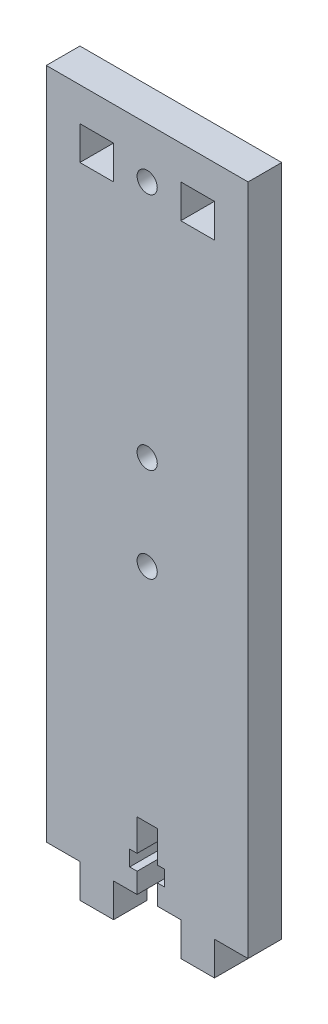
ISO-10303-21;
HEADER;
FILE_DESCRIPTION(('STEP AP214'),'2;1');
FILE_NAME('part.step','',(''),(''),'','','');
FILE_SCHEMA(('AUTOMOTIVE_DESIGN { 1 0 10303 214 1 1 1 1 }'));
ENDSEC;
DATA;
#1=APPLICATION_CONTEXT('core data for automotive mechanical design processes');
#2=APPLICATION_PROTOCOL_DEFINITION('international standard','automotive_design',2000,#1);
#3=PRODUCT_CONTEXT('',#1,'mechanical');
#4=PRODUCT('Part','Part','',(#3));
#5=PRODUCT_RELATED_PRODUCT_CATEGORY('part','',(#4));
#6=PRODUCT_DEFINITION_FORMATION('','',#4);
#7=PRODUCT_DEFINITION_CONTEXT('part definition',#1,'design');
#8=PRODUCT_DEFINITION('design','',#6,#7);
#9=PRODUCT_DEFINITION_SHAPE('','',#8);
#10=(LENGTH_UNIT() NAMED_UNIT(*) SI_UNIT(.MILLI.,.METRE.));
#11=(NAMED_UNIT(*) PLANE_ANGLE_UNIT() SI_UNIT($,.RADIAN.));
#12=(NAMED_UNIT(*) SI_UNIT($,.STERADIAN.) SOLID_ANGLE_UNIT());
#13=UNCERTAINTY_MEASURE_WITH_UNIT(LENGTH_MEASURE(1.E-05),#10,'distance_accuracy_value','');
#14=(GEOMETRIC_REPRESENTATION_CONTEXT(3) GLOBAL_UNCERTAINTY_ASSIGNED_CONTEXT((#13)) GLOBAL_UNIT_ASSIGNED_CONTEXT((#10,
#11,#12)) REPRESENTATION_CONTEXT('',''));
#15=CARTESIAN_POINT('',(0.,0.,0.));
#16=DIRECTION('',(0.,0.,1.));
#17=DIRECTION('',(1.,0.,0.));
#18=AXIS2_PLACEMENT_3D('',#15,#16,#17);
#19=CARTESIAN_POINT('',(0.,0.,5.));
#20=DIRECTION('',(0.,0.,-1.));
#21=DIRECTION('',(-1.,0.,0.));
#22=AXIS2_PLACEMENT_3D('',#19,#20,#21);
#23=PLANE('',#22);
#24=DIRECTION('',(0.,1.,0.));
#25=VECTOR('',#24,1.);
#26=CARTESIAN_POINT('',(-5.,95.,5.));
#27=LINE('',#26,#25);
#28=CARTESIAN_POINT('',(-5.,90.,5.));
#29=VERTEX_POINT('',#28);
#30=CARTESIAN_POINT('',(-5.,95.,5.));
#31=VERTEX_POINT('',#30);
#32=EDGE_CURVE('E281',#29,#31,#27,.T.);
#33=ORIENTED_EDGE('',*,*,#32,.F.);
#34=DIRECTION('',(1.,0.,0.));
#35=VECTOR('',#34,1.);
#36=CARTESIAN_POINT('',(-5.,90.,5.));
#37=LINE('',#36,#35);
#38=CARTESIAN_POINT('',(-10.,90.,5.));
#39=VERTEX_POINT('',#38);
#40=EDGE_CURVE('E289',#39,#29,#37,.T.);
#41=ORIENTED_EDGE('',*,*,#40,.F.);
#42=DIRECTION('',(0.,-1.,0.));
#43=VECTOR('',#42,1.);
#44=CARTESIAN_POINT('',(-10.,95.,5.));
#45=LINE('',#44,#43);
#46=CARTESIAN_POINT('',(-10.,95.,5.));
#47=VERTEX_POINT('',#46);
#48=EDGE_CURVE('E286',#47,#39,#45,.T.);
#49=ORIENTED_EDGE('',*,*,#48,.F.);
#50=DIRECTION('',(-1.,0.,0.));
#51=VECTOR('',#50,1.);
#52=CARTESIAN_POINT('',(-5.,95.,5.));
#53=LINE('',#52,#51);
#54=EDGE_CURVE('E283',#31,#47,#53,.T.);
#55=ORIENTED_EDGE('',*,*,#54,.F.);
#56=EDGE_LOOP('',(#33,#41,#49,#55));
#57=FACE_BOUND('',#56,.T.);
#58=DIRECTION('',(0.,-1.,0.));
#59=VECTOR('',#58,1.);
#60=CARTESIAN_POINT('',(-15.,90.,5.));
#61=LINE('',#60,#59);
#62=CARTESIAN_POINT('',(-15.,100.,5.));
#63=VERTEX_POINT('',#62);
#64=CARTESIAN_POINT('',(-15.,0.,5.));
#65=VERTEX_POINT('',#64);
#66=EDGE_CURVE('E324',#63,#65,#61,.T.);
#67=ORIENTED_EDGE('',*,*,#66,.T.);
#68=DIRECTION('',(1.,0.,0.));
#69=VECTOR('',#68,1.);
#70=CARTESIAN_POINT('',(-10.,0.,5.));
#71=LINE('',#70,#69);
#72=CARTESIAN_POINT('',(-10.,0.,5.));
#73=VERTEX_POINT('',#72);
#74=EDGE_CURVE('E326',#65,#73,#71,.T.);
#75=ORIENTED_EDGE('',*,*,#74,.T.);
#76=DIRECTION('',(0.,-1.,0.));
#77=VECTOR('',#76,1.);
#78=CARTESIAN_POINT('',(-10.,-5.,5.));
#79=LINE('',#78,#77);
#80=CARTESIAN_POINT('',(-10.,-5.,5.));
#81=VERTEX_POINT('',#80);
#82=EDGE_CURVE('E329',#73,#81,#79,.T.);
#83=ORIENTED_EDGE('',*,*,#82,.T.);
#84=DIRECTION('',(1.,0.,0.));
#85=VECTOR('',#84,1.);
#86=CARTESIAN_POINT('',(-5.,-5.,5.));
#87=LINE('',#86,#85);
#88=CARTESIAN_POINT('',(-5.,-5.,5.));
#89=VERTEX_POINT('',#88);
#90=EDGE_CURVE('E331',#81,#89,#87,.T.);
#91=ORIENTED_EDGE('',*,*,#90,.T.);
#92=DIRECTION('',(0.,1.,0.));
#93=VECTOR('',#92,1.);
#94=CARTESIAN_POINT('',(-5.,-5.,5.));
#95=LINE('',#94,#93);
#96=CARTESIAN_POINT('',(-5.,0.,5.));
#97=VERTEX_POINT('',#96);
#98=EDGE_CURVE('E333',#89,#97,#95,.T.);
#99=ORIENTED_EDGE('',*,*,#98,.T.);
#100=DIRECTION('',(1.,0.,0.));
#101=VECTOR('',#100,1.);
#102=CARTESIAN_POINT('',(-1.5,0.,5.));
#103=LINE('',#102,#101);
#104=CARTESIAN_POINT('',(-1.5,0.,5.));
#105=VERTEX_POINT('',#104);
#106=EDGE_CURVE('E335',#97,#105,#103,.T.);
#107=ORIENTED_EDGE('',*,*,#106,.T.);
#108=DIRECTION('',(0.,1.,0.));
#109=VECTOR('',#108,1.);
#110=CARTESIAN_POINT('',(-1.5,3.,5.));
#111=LINE('',#110,#109);
#112=CARTESIAN_POINT('',(-1.5,3.,5.));
#113=VERTEX_POINT('',#112);
#114=EDGE_CURVE('E337',#105,#113,#111,.T.);
#115=ORIENTED_EDGE('',*,*,#114,.T.);
#116=DIRECTION('',(-1.,0.,0.));
#117=VECTOR('',#116,1.);
#118=CARTESIAN_POINT('',(-1.5,3.,5.));
#119=LINE('',#118,#117);
#120=CARTESIAN_POINT('',(-2.6,3.,5.));
#121=VERTEX_POINT('',#120);
#122=EDGE_CURVE('E339',#113,#121,#119,.T.);
#123=ORIENTED_EDGE('',*,*,#122,.T.);
#124=DIRECTION('',(0.,1.,0.));
#125=VECTOR('',#124,1.);
#126=CARTESIAN_POINT('',(-2.6,3.,5.));
#127=LINE('',#126,#125);
#128=CARTESIAN_POINT('',(-2.6,5.3,5.));
#129=VERTEX_POINT('',#128);
#130=EDGE_CURVE('E341',#121,#129,#127,.T.);
#131=ORIENTED_EDGE('',*,*,#130,.T.);
#132=DIRECTION('',(1.,0.,0.));
#133=VECTOR('',#132,1.);
#134=CARTESIAN_POINT('',(-2.6,5.3,5.));
#135=LINE('',#134,#133);
#136=CARTESIAN_POINT('',(-1.5,5.3,5.));
#137=VERTEX_POINT('',#136);
#138=EDGE_CURVE('E343',#129,#137,#135,.T.);
#139=ORIENTED_EDGE('',*,*,#138,.T.);
#140=DIRECTION('',(0.,1.,0.));
#141=VECTOR('',#140,1.);
#142=CARTESIAN_POINT('',(-1.5,10.,5.));
#143=LINE('',#142,#141);
#144=CARTESIAN_POINT('',(-1.5,10.,5.));
#145=VERTEX_POINT('',#144);
#146=EDGE_CURVE('E345',#137,#145,#143,.T.);
#147=ORIENTED_EDGE('',*,*,#146,.T.);
#148=DIRECTION('',(1.,0.,0.));
#149=VECTOR('',#148,1.);
#150=CARTESIAN_POINT('',(1.5,10.,5.));
#151=LINE('',#150,#149);
#152=CARTESIAN_POINT('',(1.5,10.,5.));
#153=VERTEX_POINT('',#152);
#154=EDGE_CURVE('E347',#145,#153,#151,.T.);
#155=ORIENTED_EDGE('',*,*,#154,.T.);
#156=DIRECTION('',(0.,-1.,0.));
#157=VECTOR('',#156,1.);
#158=CARTESIAN_POINT('',(1.5,5.3,5.));
#159=LINE('',#158,#157);
#160=CARTESIAN_POINT('',(1.5,5.3,5.));
#161=VERTEX_POINT('',#160);
#162=EDGE_CURVE('E349',#153,#161,#159,.T.);
#163=ORIENTED_EDGE('',*,*,#162,.T.);
#164=DIRECTION('',(1.,0.,0.));
#165=VECTOR('',#164,1.);
#166=CARTESIAN_POINT('',(1.5,5.3,5.));
#167=LINE('',#166,#165);
#168=CARTESIAN_POINT('',(2.6,5.3,5.));
#169=VERTEX_POINT('',#168);
#170=EDGE_CURVE('E351',#161,#169,#167,.T.);
#171=ORIENTED_EDGE('',*,*,#170,.T.);
#172=DIRECTION('',(0.,-1.,0.));
#173=VECTOR('',#172,1.);
#174=CARTESIAN_POINT('',(2.6,5.3,5.));
#175=LINE('',#174,#173);
#176=CARTESIAN_POINT('',(2.6,3.,5.));
#177=VERTEX_POINT('',#176);
#178=EDGE_CURVE('E353',#169,#177,#175,.T.);
#179=ORIENTED_EDGE('',*,*,#178,.T.);
#180=DIRECTION('',(-1.,0.,0.));
#181=VECTOR('',#180,1.);
#182=CARTESIAN_POINT('',(2.6,3.,5.));
#183=LINE('',#182,#181);
#184=CARTESIAN_POINT('',(1.5,3.,5.));
#185=VERTEX_POINT('',#184);
#186=EDGE_CURVE('E355',#177,#185,#183,.T.);
#187=ORIENTED_EDGE('',*,*,#186,.T.);
#188=DIRECTION('',(0.,-1.,0.));
#189=VECTOR('',#188,1.);
#190=CARTESIAN_POINT('',(1.5,0.,5.));
#191=LINE('',#190,#189);
#192=CARTESIAN_POINT('',(1.5,0.,5.));
#193=VERTEX_POINT('',#192);
#194=EDGE_CURVE('E357',#185,#193,#191,.T.);
#195=ORIENTED_EDGE('',*,*,#194,.T.);
#196=DIRECTION('',(1.,0.,0.));
#197=VECTOR('',#196,1.);
#198=CARTESIAN_POINT('',(1.5,0.,5.));
#199=LINE('',#198,#197);
#200=CARTESIAN_POINT('',(5.,0.,5.));
#201=VERTEX_POINT('',#200);
#202=EDGE_CURVE('E359',#193,#201,#199,.T.);
#203=ORIENTED_EDGE('',*,*,#202,.T.);
#204=DIRECTION('',(0.,-1.,0.));
#205=VECTOR('',#204,1.);
#206=CARTESIAN_POINT('',(5.,0.,5.));
#207=LINE('',#206,#205);
#208=CARTESIAN_POINT('',(5.,-5.,5.));
#209=VERTEX_POINT('',#208);
#210=EDGE_CURVE('E361',#201,#209,#207,.T.);
#211=ORIENTED_EDGE('',*,*,#210,.T.);
#212=DIRECTION('',(1.,0.,0.));
#213=VECTOR('',#212,1.);
#214=CARTESIAN_POINT('',(5.,-5.,5.));
#215=LINE('',#214,#213);
#216=CARTESIAN_POINT('',(10.,-5.,5.));
#217=VERTEX_POINT('',#216);
#218=EDGE_CURVE('E363',#209,#217,#215,.T.);
#219=ORIENTED_EDGE('',*,*,#218,.T.);
#220=DIRECTION('',(0.,1.,0.));
#221=VECTOR('',#220,1.);
#222=CARTESIAN_POINT('',(10.,-5.,5.));
#223=LINE('',#222,#221);
#224=CARTESIAN_POINT('',(10.,0.,5.));
#225=VERTEX_POINT('',#224);
#226=EDGE_CURVE('E365',#217,#225,#223,.T.);
#227=ORIENTED_EDGE('',*,*,#226,.T.);
#228=DIRECTION('',(1.,0.,0.));
#229=VECTOR('',#228,1.);
#230=CARTESIAN_POINT('',(15.,0.,5.));
#231=LINE('',#230,#229);
#232=CARTESIAN_POINT('',(15.,0.,5.));
#233=VERTEX_POINT('',#232);
#234=EDGE_CURVE('E367',#225,#233,#231,.T.);
#235=ORIENTED_EDGE('',*,*,#234,.T.);
#236=DIRECTION('',(0.,1.,0.));
#237=VECTOR('',#236,1.);
#238=CARTESIAN_POINT('',(15.,90.,5.));
#239=LINE('',#238,#237);
#240=CARTESIAN_POINT('',(15.,100.,5.));
#241=VERTEX_POINT('',#240);
#242=EDGE_CURVE('E369',#233,#241,#239,.T.);
#243=ORIENTED_EDGE('',*,*,#242,.T.);
#244=DIRECTION('',(-1.,0.,0.));
#245=VECTOR('',#244,1.);
#246=CARTESIAN_POINT('',(-15.,100.,5.));
#247=LINE('',#246,#245);
#248=EDGE_CURVE('E371',#241,#63,#247,.T.);
#249=ORIENTED_EDGE('',*,*,#248,.T.);
#250=EDGE_LOOP('',(#67,#75,#83,#91,#99,#107,#115,#123,#131,#139,#147,#155,#163,#171,#179,#187,
#195,#203,#211,#219,#227,#235,#243,#249));
#251=FACE_BOUND('',#250,.T.);
#252=CARTESIAN_POINT('',(0.,57.,5.));
#253=DIRECTION('',(0.,0.,1.));
#254=DIRECTION('',(1.,0.,0.));
#255=AXIS2_PLACEMENT_3D('',#252,#253,#254);
#256=CIRCLE('',#255,1.5);
#257=CARTESIAN_POINT('',(1.5,57.,5.));
#258=VERTEX_POINT('',#257);
#259=EDGE_CURVE('E318',#258,#258,#256,.T.);
#260=ORIENTED_EDGE('',*,*,#259,.F.);
#261=EDGE_LOOP('',(#260));
#262=FACE_BOUND('',#261,.T.);
#263=CARTESIAN_POINT('',(0.,43.,5.));
#264=DIRECTION('',(0.,0.,1.));
#265=DIRECTION('',(1.,0.,0.));
#266=AXIS2_PLACEMENT_3D('',#263,#264,#265);
#267=CIRCLE('',#266,1.5);
#268=CARTESIAN_POINT('',(1.5,43.,5.));
#269=VERTEX_POINT('',#268);
#270=EDGE_CURVE('E312',#269,#269,#267,.T.);
#271=ORIENTED_EDGE('',*,*,#270,.F.);
#272=EDGE_LOOP('',(#271));
#273=FACE_BOUND('',#272,.T.);
#274=DIRECTION('',(0.,-1.,0.));
#275=VECTOR('',#274,1.);
#276=CARTESIAN_POINT('',(5.,95.,5.));
#277=LINE('',#276,#275);
#278=CARTESIAN_POINT('',(5.,95.,5.));
#279=VERTEX_POINT('',#278);
#280=CARTESIAN_POINT('',(5.,90.,5.));
#281=VERTEX_POINT('',#280);
#282=EDGE_CURVE('E242',#279,#281,#277,.T.);
#283=ORIENTED_EDGE('',*,*,#282,.F.);
#284=DIRECTION('',(-1.,0.,0.));
#285=VECTOR('',#284,1.);
#286=CARTESIAN_POINT('',(5.,95.,5.));
#287=LINE('',#286,#285);
#288=CARTESIAN_POINT('',(10.,95.,5.));
#289=VERTEX_POINT('',#288);
#290=EDGE_CURVE('E265',#289,#279,#287,.T.);
#291=ORIENTED_EDGE('',*,*,#290,.F.);
#292=DIRECTION('',(0.,1.,0.));
#293=VECTOR('',#292,1.);
#294=CARTESIAN_POINT('',(10.,95.,5.));
#295=LINE('',#294,#293);
#296=CARTESIAN_POINT('',(10.,90.,5.));
#297=VERTEX_POINT('',#296);
#298=EDGE_CURVE('E263',#297,#289,#295,.T.);
#299=ORIENTED_EDGE('',*,*,#298,.F.);
#300=DIRECTION('',(1.,0.,0.));
#301=VECTOR('',#300,1.);
#302=CARTESIAN_POINT('',(5.,90.,5.));
#303=LINE('',#302,#301);
#304=EDGE_CURVE('E250',#281,#297,#303,.T.);
#305=ORIENTED_EDGE('',*,*,#304,.F.);
#306=EDGE_LOOP('',(#283,#291,#299,#305));
#307=FACE_BOUND('',#306,.T.);
#308=CARTESIAN_POINT('',(0.,92.5,5.));
#309=DIRECTION('',(0.,0.,1.));
#310=DIRECTION('',(1.,0.,0.));
#311=AXIS2_PLACEMENT_3D('',#308,#309,#310);
#312=CIRCLE('',#311,1.5);
#313=CARTESIAN_POINT('',(1.5,92.5,5.));
#314=VERTEX_POINT('',#313);
#315=EDGE_CURVE('E271',#314,#314,#312,.T.);
#316=ORIENTED_EDGE('',*,*,#315,.F.);
#317=EDGE_LOOP('',(#316));
#318=FACE_BOUND('',#317,.T.);
#319=ADVANCED_FACE('F33',(#57,#251,#262,#273,#307,#318),#23,.F.);
#320=CARTESIAN_POINT('',(0.,0.,0.));
#321=DIRECTION('',(0.,0.,-1.));
#322=DIRECTION('',(-1.,0.,0.));
#323=AXIS2_PLACEMENT_3D('',#320,#321,#322);
#324=PLANE('',#323);
#325=DIRECTION('',(-1.,0.,0.));
#326=VECTOR('',#325,1.);
#327=CARTESIAN_POINT('',(5.,95.,0.));
#328=LINE('',#327,#326);
#329=CARTESIAN_POINT('',(10.,95.,0.));
#330=VERTEX_POINT('',#329);
#331=CARTESIAN_POINT('',(5.,95.,0.));
#332=VERTEX_POINT('',#331);
#333=EDGE_CURVE('E251',#330,#332,#328,.T.);
#334=ORIENTED_EDGE('',*,*,#333,.T.);
#335=DIRECTION('',(0.,-1.,0.));
#336=VECTOR('',#335,1.);
#337=CARTESIAN_POINT('',(5.,95.,0.));
#338=LINE('',#337,#336);
#339=CARTESIAN_POINT('',(5.,90.,0.));
#340=VERTEX_POINT('',#339);
#341=EDGE_CURVE('E56',#332,#340,#338,.T.);
#342=ORIENTED_EDGE('',*,*,#341,.T.);
#343=DIRECTION('',(1.,0.,0.));
#344=VECTOR('',#343,1.);
#345=CARTESIAN_POINT('',(5.,90.,0.));
#346=LINE('',#345,#344);
#347=CARTESIAN_POINT('',(10.,90.,0.));
#348=VERTEX_POINT('',#347);
#349=EDGE_CURVE('E257',#340,#348,#346,.T.);
#350=ORIENTED_EDGE('',*,*,#349,.T.);
#351=DIRECTION('',(0.,1.,0.));
#352=VECTOR('',#351,1.);
#353=CARTESIAN_POINT('',(10.,95.,0.));
#354=LINE('',#353,#352);
#355=EDGE_CURVE('E273',#348,#330,#354,.T.);
#356=ORIENTED_EDGE('',*,*,#355,.T.);
#357=EDGE_LOOP('',(#334,#342,#350,#356));
#358=FACE_BOUND('',#357,.T.);
#359=DIRECTION('',(1.,0.,0.));
#360=VECTOR('',#359,1.);
#361=CARTESIAN_POINT('',(-5.,90.,0.));
#362=LINE('',#361,#360);
#363=CARTESIAN_POINT('',(-10.,90.,0.));
#364=VERTEX_POINT('',#363);
#365=CARTESIAN_POINT('',(-5.,90.,0.));
#366=VERTEX_POINT('',#365);
#367=EDGE_CURVE('E284',#364,#366,#362,.T.);
#368=ORIENTED_EDGE('',*,*,#367,.T.);
#369=DIRECTION('',(0.,1.,0.));
#370=VECTOR('',#369,1.);
#371=CARTESIAN_POINT('',(-5.,95.,0.));
#372=LINE('',#371,#370);
#373=CARTESIAN_POINT('',(-5.,95.,0.));
#374=VERTEX_POINT('',#373);
#375=EDGE_CURVE('E258',#366,#374,#372,.T.);
#376=ORIENTED_EDGE('',*,*,#375,.T.);
#377=DIRECTION('',(-1.,0.,0.));
#378=VECTOR('',#377,1.);
#379=CARTESIAN_POINT('',(-5.,95.,0.));
#380=LINE('',#379,#378);
#381=CARTESIAN_POINT('',(-10.,95.,0.));
#382=VERTEX_POINT('',#381);
#383=EDGE_CURVE('E294',#374,#382,#380,.T.);
#384=ORIENTED_EDGE('',*,*,#383,.T.);
#385=DIRECTION('',(0.,-1.,0.));
#386=VECTOR('',#385,1.);
#387=CARTESIAN_POINT('',(-10.,95.,0.));
#388=LINE('',#387,#386);
#389=EDGE_CURVE('E297',#382,#364,#388,.T.);
#390=ORIENTED_EDGE('',*,*,#389,.T.);
#391=EDGE_LOOP('',(#368,#376,#384,#390));
#392=FACE_BOUND('',#391,.T.);
#393=CARTESIAN_POINT('',(0.,43.,0.));
#394=DIRECTION('',(0.,0.,1.));
#395=DIRECTION('',(1.,0.,0.));
#396=AXIS2_PLACEMENT_3D('',#393,#394,#395);
#397=CIRCLE('',#396,1.5);
#398=CARTESIAN_POINT('',(1.5,43.,0.));
#399=VERTEX_POINT('',#398);
#400=EDGE_CURVE('E311',#399,#399,#397,.T.);
#401=ORIENTED_EDGE('',*,*,#400,.T.);
#402=EDGE_LOOP('',(#401));
#403=FACE_BOUND('',#402,.T.);
#404=DIRECTION('',(0.,-1.,0.));
#405=VECTOR('',#404,1.);
#406=CARTESIAN_POINT('',(-15.,0.,0.));
#407=LINE('',#406,#405);
#408=CARTESIAN_POINT('',(-15.,100.,0.));
#409=VERTEX_POINT('',#408);
#410=CARTESIAN_POINT('',(-15.,0.,0.));
#411=VERTEX_POINT('',#410);
#412=EDGE_CURVE('E321',#409,#411,#407,.T.);
#413=ORIENTED_EDGE('',*,*,#412,.F.);
#414=DIRECTION('',(-1.,0.,0.));
#415=VECTOR('',#414,1.);
#416=CARTESIAN_POINT('',(-15.,100.,0.));
#417=LINE('',#416,#415);
#418=CARTESIAN_POINT('',(15.,100.,0.));
#419=VERTEX_POINT('',#418);
#420=EDGE_CURVE('E327',#419,#409,#417,.T.);
#421=ORIENTED_EDGE('',*,*,#420,.F.);
#422=DIRECTION('',(0.,1.,0.));
#423=VECTOR('',#422,1.);
#424=CARTESIAN_POINT('',(15.,100.,0.));
#425=LINE('',#424,#423);
#426=CARTESIAN_POINT('',(15.,0.,0.));
#427=VERTEX_POINT('',#426);
#428=EDGE_CURVE('E418',#427,#419,#425,.T.);
#429=ORIENTED_EDGE('',*,*,#428,.F.);
#430=DIRECTION('',(1.,0.,0.));
#431=VECTOR('',#430,1.);
#432=CARTESIAN_POINT('',(15.,0.,0.));
#433=LINE('',#432,#431);
#434=CARTESIAN_POINT('',(10.,0.,0.));
#435=VERTEX_POINT('',#434);
#436=EDGE_CURVE('E415',#435,#427,#433,.T.);
#437=ORIENTED_EDGE('',*,*,#436,.F.);
#438=DIRECTION('',(0.,1.,0.));
#439=VECTOR('',#438,1.);
#440=CARTESIAN_POINT('',(10.,-5.,0.));
#441=LINE('',#440,#439);
#442=CARTESIAN_POINT('',(10.,-5.,0.));
#443=VERTEX_POINT('',#442);
#444=EDGE_CURVE('E413',#443,#435,#441,.T.);
#445=ORIENTED_EDGE('',*,*,#444,.F.);
#446=DIRECTION('',(1.,0.,0.));
#447=VECTOR('',#446,1.);
#448=CARTESIAN_POINT('',(5.,-5.,0.));
#449=LINE('',#448,#447);
#450=CARTESIAN_POINT('',(5.,-5.,0.));
#451=VERTEX_POINT('',#450);
#452=EDGE_CURVE('E411',#451,#443,#449,.T.);
#453=ORIENTED_EDGE('',*,*,#452,.F.);
#454=DIRECTION('',(0.,-1.,0.));
#455=VECTOR('',#454,1.);
#456=CARTESIAN_POINT('',(5.,0.,0.));
#457=LINE('',#456,#455);
#458=CARTESIAN_POINT('',(5.,0.,0.));
#459=VERTEX_POINT('',#458);
#460=EDGE_CURVE('E409',#459,#451,#457,.T.);
#461=ORIENTED_EDGE('',*,*,#460,.F.);
#462=DIRECTION('',(1.,0.,0.));
#463=VECTOR('',#462,1.);
#464=CARTESIAN_POINT('',(1.5,0.,0.));
#465=LINE('',#464,#463);
#466=CARTESIAN_POINT('',(1.5,0.,0.));
#467=VERTEX_POINT('',#466);
#468=EDGE_CURVE('E407',#467,#459,#465,.T.);
#469=ORIENTED_EDGE('',*,*,#468,.F.);
#470=DIRECTION('',(0.,-1.,0.));
#471=VECTOR('',#470,1.);
#472=CARTESIAN_POINT('',(1.5,0.,0.));
#473=LINE('',#472,#471);
#474=CARTESIAN_POINT('',(1.5,3.,0.));
#475=VERTEX_POINT('',#474);
#476=EDGE_CURVE('E405',#475,#467,#473,.T.);
#477=ORIENTED_EDGE('',*,*,#476,.F.);
#478=DIRECTION('',(-1.,0.,0.));
#479=VECTOR('',#478,1.);
#480=CARTESIAN_POINT('',(2.6,3.,0.));
#481=LINE('',#480,#479);
#482=CARTESIAN_POINT('',(2.6,3.,0.));
#483=VERTEX_POINT('',#482);
#484=EDGE_CURVE('E403',#483,#475,#481,.T.);
#485=ORIENTED_EDGE('',*,*,#484,.F.);
#486=DIRECTION('',(0.,-1.,0.));
#487=VECTOR('',#486,1.);
#488=CARTESIAN_POINT('',(2.6,5.3,0.));
#489=LINE('',#488,#487);
#490=CARTESIAN_POINT('',(2.6,5.3,0.));
#491=VERTEX_POINT('',#490);
#492=EDGE_CURVE('E401',#491,#483,#489,.T.);
#493=ORIENTED_EDGE('',*,*,#492,.F.);
#494=DIRECTION('',(1.,0.,0.));
#495=VECTOR('',#494,1.);
#496=CARTESIAN_POINT('',(1.5,5.3,0.));
#497=LINE('',#496,#495);
#498=CARTESIAN_POINT('',(1.5,5.3,0.));
#499=VERTEX_POINT('',#498);
#500=EDGE_CURVE('E399',#499,#491,#497,.T.);
#501=ORIENTED_EDGE('',*,*,#500,.F.);
#502=DIRECTION('',(0.,-1.,0.));
#503=VECTOR('',#502,1.);
#504=CARTESIAN_POINT('',(1.5,5.3,0.));
#505=LINE('',#504,#503);
#506=CARTESIAN_POINT('',(1.5,10.,0.));
#507=VERTEX_POINT('',#506);
#508=EDGE_CURVE('E397',#507,#499,#505,.T.);
#509=ORIENTED_EDGE('',*,*,#508,.F.);
#510=DIRECTION('',(1.,0.,0.));
#511=VECTOR('',#510,1.);
#512=CARTESIAN_POINT('',(1.5,10.,0.));
#513=LINE('',#512,#511);
#514=CARTESIAN_POINT('',(-1.5,10.,0.));
#515=VERTEX_POINT('',#514);
#516=EDGE_CURVE('E395',#515,#507,#513,.T.);
#517=ORIENTED_EDGE('',*,*,#516,.F.);
#518=DIRECTION('',(0.,1.,0.));
#519=VECTOR('',#518,1.);
#520=CARTESIAN_POINT('',(-1.5,10.,0.));
#521=LINE('',#520,#519);
#522=CARTESIAN_POINT('',(-1.5,5.3,0.));
#523=VERTEX_POINT('',#522);
#524=EDGE_CURVE('E393',#523,#515,#521,.T.);
#525=ORIENTED_EDGE('',*,*,#524,.F.);
#526=DIRECTION('',(1.,0.,0.));
#527=VECTOR('',#526,1.);
#528=CARTESIAN_POINT('',(-2.6,5.3,0.));
#529=LINE('',#528,#527);
#530=CARTESIAN_POINT('',(-2.6,5.3,0.));
#531=VERTEX_POINT('',#530);
#532=EDGE_CURVE('E391',#531,#523,#529,.T.);
#533=ORIENTED_EDGE('',*,*,#532,.F.);
#534=DIRECTION('',(0.,1.,0.));
#535=VECTOR('',#534,1.);
#536=CARTESIAN_POINT('',(-2.6,3.,0.));
#537=LINE('',#536,#535);
#538=CARTESIAN_POINT('',(-2.6,3.,0.));
#539=VERTEX_POINT('',#538);
#540=EDGE_CURVE('E389',#539,#531,#537,.T.);
#541=ORIENTED_EDGE('',*,*,#540,.F.);
#542=DIRECTION('',(-1.,0.,0.));
#543=VECTOR('',#542,1.);
#544=CARTESIAN_POINT('',(-1.5,3.,0.));
#545=LINE('',#544,#543);
#546=CARTESIAN_POINT('',(-1.5,3.,0.));
#547=VERTEX_POINT('',#546);
#548=EDGE_CURVE('E387',#547,#539,#545,.T.);
#549=ORIENTED_EDGE('',*,*,#548,.F.);
#550=DIRECTION('',(0.,1.,0.));
#551=VECTOR('',#550,1.);
#552=CARTESIAN_POINT('',(-1.5,3.,0.));
#553=LINE('',#552,#551);
#554=CARTESIAN_POINT('',(-1.5,0.,0.));
#555=VERTEX_POINT('',#554);
#556=EDGE_CURVE('E385',#555,#547,#553,.T.);
#557=ORIENTED_EDGE('',*,*,#556,.F.);
#558=DIRECTION('',(1.,0.,0.));
#559=VECTOR('',#558,1.);
#560=CARTESIAN_POINT('',(-1.5,0.,0.));
#561=LINE('',#560,#559);
#562=CARTESIAN_POINT('',(-5.,0.,0.));
#563=VERTEX_POINT('',#562);
#564=EDGE_CURVE('E383',#563,#555,#561,.T.);
#565=ORIENTED_EDGE('',*,*,#564,.F.);
#566=DIRECTION('',(0.,1.,0.));
#567=VECTOR('',#566,1.);
#568=CARTESIAN_POINT('',(-5.,-5.,0.));
#569=LINE('',#568,#567);
#570=CARTESIAN_POINT('',(-5.,-5.,0.));
#571=VERTEX_POINT('',#570);
#572=EDGE_CURVE('E381',#571,#563,#569,.T.);
#573=ORIENTED_EDGE('',*,*,#572,.F.);
#574=DIRECTION('',(1.,0.,0.));
#575=VECTOR('',#574,1.);
#576=CARTESIAN_POINT('',(-5.,-5.,0.));
#577=LINE('',#576,#575);
#578=CARTESIAN_POINT('',(-10.,-5.,0.));
#579=VERTEX_POINT('',#578);
#580=EDGE_CURVE('E379',#579,#571,#577,.T.);
#581=ORIENTED_EDGE('',*,*,#580,.F.);
#582=DIRECTION('',(0.,-1.,0.));
#583=VECTOR('',#582,1.);
#584=CARTESIAN_POINT('',(-10.,-5.,0.));
#585=LINE('',#584,#583);
#586=CARTESIAN_POINT('',(-10.,0.,0.));
#587=VERTEX_POINT('',#586);
#588=EDGE_CURVE('E377',#587,#579,#585,.T.);
#589=ORIENTED_EDGE('',*,*,#588,.F.);
#590=DIRECTION('',(1.,0.,0.));
#591=VECTOR('',#590,1.);
#592=CARTESIAN_POINT('',(-10.,0.,0.));
#593=LINE('',#592,#591);
#594=EDGE_CURVE('E375',#411,#587,#593,.T.);
#595=ORIENTED_EDGE('',*,*,#594,.F.);
#596=EDGE_LOOP('',(#413,#421,#429,#437,#445,#453,#461,#469,#477,#485,#493,#501,#509,#517,#525,
#533,#541,#549,#557,#565,#573,#581,#589,#595));
#597=FACE_BOUND('',#596,.T.);
#598=CARTESIAN_POINT('',(0.,57.,0.));
#599=DIRECTION('',(0.,0.,1.));
#600=DIRECTION('',(1.,0.,0.));
#601=AXIS2_PLACEMENT_3D('',#598,#599,#600);
#602=CIRCLE('',#601,1.5);
#603=CARTESIAN_POINT('',(1.5,57.,0.));
#604=VERTEX_POINT('',#603);
#605=EDGE_CURVE('E315',#604,#604,#602,.T.);
#606=ORIENTED_EDGE('',*,*,#605,.T.);
#607=EDGE_LOOP('',(#606));
#608=FACE_BOUND('',#607,.T.);
#609=CARTESIAN_POINT('',(0.,92.5,0.));
#610=DIRECTION('',(0.,0.,1.));
#611=DIRECTION('',(1.,0.,0.));
#612=AXIS2_PLACEMENT_3D('',#609,#610,#611);
#613=CIRCLE('',#612,1.5);
#614=CARTESIAN_POINT('',(1.5,92.5,0.));
#615=VERTEX_POINT('',#614);
#616=EDGE_CURVE('E934',#615,#615,#613,.T.);
#617=ORIENTED_EDGE('',*,*,#616,.T.);
#618=EDGE_LOOP('',(#617));
#619=FACE_BOUND('',#618,.T.);
#620=ADVANCED_FACE('F498',(#358,#392,#403,#597,#608,#619),#324,.T.);
#621=CARTESIAN_POINT('',(-15.,0.,5.));
#622=DIRECTION('',(1.,0.,0.));
#623=DIRECTION('',(0.,1.,0.));
#624=AXIS2_PLACEMENT_3D('',#621,#622,#623);
#625=PLANE('',#624);
#626=ORIENTED_EDGE('',*,*,#412,.T.);
#627=DIRECTION('',(0.,0.,-1.));
#628=VECTOR('',#627,1.);
#629=CARTESIAN_POINT('',(-15.,0.,5.));
#630=LINE('',#629,#628);
#631=EDGE_CURVE('E11',#65,#411,#630,.T.);
#632=ORIENTED_EDGE('',*,*,#631,.F.);
#633=ORIENTED_EDGE('',*,*,#66,.F.);
#634=DIRECTION('',(0.,0.,-1.));
#635=VECTOR('',#634,1.);
#636=CARTESIAN_POINT('',(-15.,100.,5.));
#637=LINE('',#636,#635);
#638=EDGE_CURVE('E373',#63,#409,#637,.T.);
#639=ORIENTED_EDGE('',*,*,#638,.T.);
#640=EDGE_LOOP('',(#626,#632,#633,#639));
#641=FACE_BOUND('',#640,.T.);
#642=ADVANCED_FACE('F35',(#641),#625,.F.);
#643=CARTESIAN_POINT('',(-10.,0.,5.));
#644=DIRECTION('',(0.,1.,0.));
#645=DIRECTION('',(-1.,0.,0.));
#646=AXIS2_PLACEMENT_3D('',#643,#644,#645);
#647=PLANE('',#646);
#648=ORIENTED_EDGE('',*,*,#594,.T.);
#649=DIRECTION('',(0.,0.,-1.));
#650=VECTOR('',#649,1.);
#651=CARTESIAN_POINT('',(-10.,0.,5.));
#652=LINE('',#651,#650);
#653=EDGE_CURVE('E41',#73,#587,#652,.T.);
#654=ORIENTED_EDGE('',*,*,#653,.F.);
#655=ORIENTED_EDGE('',*,*,#74,.F.);
#656=ORIENTED_EDGE('',*,*,#631,.T.);
#657=EDGE_LOOP('',(#648,#654,#655,#656));
#658=FACE_BOUND('',#657,.T.);
#659=ADVANCED_FACE('F516',(#658),#647,.F.);
#660=CARTESIAN_POINT('',(-10.,-5.,5.));
#661=DIRECTION('',(1.,0.,0.));
#662=DIRECTION('',(0.,0.,-1.));
#663=AXIS2_PLACEMENT_3D('',#660,#661,#662);
#664=PLANE('',#663);
#665=ORIENTED_EDGE('',*,*,#588,.T.);
#666=DIRECTION('',(0.,0.,-1.));
#667=VECTOR('',#666,1.);
#668=CARTESIAN_POINT('',(-10.,-5.,5.));
#669=LINE('',#668,#667);
#670=EDGE_CURVE('E484',#81,#579,#669,.T.);
#671=ORIENTED_EDGE('',*,*,#670,.F.);
#672=ORIENTED_EDGE('',*,*,#82,.F.);
#673=ORIENTED_EDGE('',*,*,#653,.T.);
#674=EDGE_LOOP('',(#665,#671,#672,#673));
#675=FACE_BOUND('',#674,.T.);
#676=ADVANCED_FACE('F491',(#675),#664,.F.);
#677=CARTESIAN_POINT('',(-5.,-5.,5.));
#678=DIRECTION('',(0.,1.,0.));
#679=DIRECTION('',(0.,0.,1.));
#680=AXIS2_PLACEMENT_3D('',#677,#678,#679);
#681=PLANE('',#680);
#682=ORIENTED_EDGE('',*,*,#580,.T.);
#683=DIRECTION('',(0.,0.,-1.));
#684=VECTOR('',#683,1.);
#685=CARTESIAN_POINT('',(-5.,-5.,5.));
#686=LINE('',#685,#684);
#687=EDGE_CURVE('E481',#89,#571,#686,.T.);
#688=ORIENTED_EDGE('',*,*,#687,.F.);
#689=ORIENTED_EDGE('',*,*,#90,.F.);
#690=ORIENTED_EDGE('',*,*,#670,.T.);
#691=EDGE_LOOP('',(#682,#688,#689,#690));
#692=FACE_BOUND('',#691,.T.);
#693=ADVANCED_FACE('F504',(#692),#681,.F.);
#694=CARTESIAN_POINT('',(-5.,-5.,5.));
#695=DIRECTION('',(-1.,0.,0.));
#696=DIRECTION('',(0.,-1.,0.));
#697=AXIS2_PLACEMENT_3D('',#694,#695,#696);
#698=PLANE('',#697);
#699=ORIENTED_EDGE('',*,*,#572,.T.);
#700=DIRECTION('',(0.,0.,-1.));
#701=VECTOR('',#700,1.);
#702=CARTESIAN_POINT('',(-5.,0.,5.));
#703=LINE('',#702,#701);
#704=EDGE_CURVE('E478',#97,#563,#703,.T.);
#705=ORIENTED_EDGE('',*,*,#704,.F.);
#706=ORIENTED_EDGE('',*,*,#98,.F.);
#707=ORIENTED_EDGE('',*,*,#687,.T.);
#708=EDGE_LOOP('',(#699,#705,#706,#707));
#709=FACE_BOUND('',#708,.T.);
#710=ADVANCED_FACE('F508',(#709),#698,.F.);
#711=CARTESIAN_POINT('',(-1.5,0.,5.));
#712=DIRECTION('',(0.,1.,0.));
#713=DIRECTION('',(-1.,0.,0.));
#714=AXIS2_PLACEMENT_3D('',#711,#712,#713);
#715=PLANE('',#714);
#716=ORIENTED_EDGE('',*,*,#564,.T.);
#717=DIRECTION('',(0.,0.,-1.));
#718=VECTOR('',#717,1.);
#719=CARTESIAN_POINT('',(-1.5,0.,5.));
#720=LINE('',#719,#718);
#721=EDGE_CURVE('E475',#105,#555,#720,.T.);
#722=ORIENTED_EDGE('',*,*,#721,.F.);
#723=ORIENTED_EDGE('',*,*,#106,.F.);
#724=ORIENTED_EDGE('',*,*,#704,.T.);
#725=EDGE_LOOP('',(#716,#722,#723,#724));
#726=FACE_BOUND('',#725,.T.);
#727=ADVANCED_FACE('F608',(#726),#715,.F.);
#728=CARTESIAN_POINT('',(-1.5,3.,5.));
#729=DIRECTION('',(-1.,0.,0.));
#730=DIRECTION('',(0.,0.,1.));
#731=AXIS2_PLACEMENT_3D('',#728,#729,#730);
#732=PLANE('',#731);
#733=ORIENTED_EDGE('',*,*,#556,.T.);
#734=DIRECTION('',(0.,0.,-1.));
#735=VECTOR('',#734,1.);
#736=CARTESIAN_POINT('',(-1.5,3.,5.));
#737=LINE('',#736,#735);
#738=EDGE_CURVE('E472',#113,#547,#737,.T.);
#739=ORIENTED_EDGE('',*,*,#738,.F.);
#740=ORIENTED_EDGE('',*,*,#114,.F.);
#741=ORIENTED_EDGE('',*,*,#721,.T.);
#742=EDGE_LOOP('',(#733,#739,#740,#741));
#743=FACE_BOUND('',#742,.T.);
#744=ADVANCED_FACE('F606',(#743),#732,.F.);
#745=CARTESIAN_POINT('',(-1.5,3.,5.));
#746=DIRECTION('',(0.,-1.,0.));
#747=DIRECTION('',(0.,0.,-1.));
#748=AXIS2_PLACEMENT_3D('',#745,#746,#747);
#749=PLANE('',#748);
#750=ORIENTED_EDGE('',*,*,#548,.T.);
#751=DIRECTION('',(0.,0.,-1.));
#752=VECTOR('',#751,1.);
#753=CARTESIAN_POINT('',(-2.6,3.,5.));
#754=LINE('',#753,#752);
#755=EDGE_CURVE('E469',#121,#539,#754,.T.);
#756=ORIENTED_EDGE('',*,*,#755,.F.);
#757=ORIENTED_EDGE('',*,*,#122,.F.);
#758=ORIENTED_EDGE('',*,*,#738,.T.);
#759=EDGE_LOOP('',(#750,#756,#757,#758));
#760=FACE_BOUND('',#759,.T.);
#761=ADVANCED_FACE('F601',(#760),#749,.F.);
#762=CARTESIAN_POINT('',(-2.6,3.,5.));
#763=DIRECTION('',(-1.,0.,0.));
#764=DIRECTION('',(0.,-1.,0.));
#765=AXIS2_PLACEMENT_3D('',#762,#763,#764);
#766=PLANE('',#765);
#767=ORIENTED_EDGE('',*,*,#540,.T.);
#768=DIRECTION('',(0.,0.,-1.));
#769=VECTOR('',#768,1.);
#770=CARTESIAN_POINT('',(-2.6,5.3,5.));
#771=LINE('',#770,#769);
#772=EDGE_CURVE('E466',#129,#531,#771,.T.);
#773=ORIENTED_EDGE('',*,*,#772,.F.);
#774=ORIENTED_EDGE('',*,*,#130,.F.);
#775=ORIENTED_EDGE('',*,*,#755,.T.);
#776=EDGE_LOOP('',(#767,#773,#774,#775));
#777=FACE_BOUND('',#776,.T.);
#778=ADVANCED_FACE('F596',(#777),#766,.F.);
#779=CARTESIAN_POINT('',(-2.6,5.3,5.));
#780=DIRECTION('',(0.,1.,0.));
#781=DIRECTION('',(-1.,0.,0.));
#782=AXIS2_PLACEMENT_3D('',#779,#780,#781);
#783=PLANE('',#782);
#784=ORIENTED_EDGE('',*,*,#532,.T.);
#785=DIRECTION('',(0.,0.,-1.));
#786=VECTOR('',#785,1.);
#787=CARTESIAN_POINT('',(-1.5,5.3,5.));
#788=LINE('',#787,#786);
#789=EDGE_CURVE('E463',#137,#523,#788,.T.);
#790=ORIENTED_EDGE('',*,*,#789,.F.);
#791=ORIENTED_EDGE('',*,*,#138,.F.);
#792=ORIENTED_EDGE('',*,*,#772,.T.);
#793=EDGE_LOOP('',(#784,#790,#791,#792));
#794=FACE_BOUND('',#793,.T.);
#795=ADVANCED_FACE('F592',(#794),#783,.F.);
#796=CARTESIAN_POINT('',(-1.5,10.,5.));
#797=DIRECTION('',(-1.,0.,0.));
#798=DIRECTION('',(0.,-1.,0.));
#799=AXIS2_PLACEMENT_3D('',#796,#797,#798);
#800=PLANE('',#799);
#801=ORIENTED_EDGE('',*,*,#524,.T.);
#802=DIRECTION('',(0.,0.,-1.));
#803=VECTOR('',#802,1.);
#804=CARTESIAN_POINT('',(-1.5,10.,5.));
#805=LINE('',#804,#803);
#806=EDGE_CURVE('E460',#145,#515,#805,.T.);
#807=ORIENTED_EDGE('',*,*,#806,.F.);
#808=ORIENTED_EDGE('',*,*,#146,.F.);
#809=ORIENTED_EDGE('',*,*,#789,.T.);
#810=EDGE_LOOP('',(#801,#807,#808,#809));
#811=FACE_BOUND('',#810,.T.);
#812=ADVANCED_FACE('F587',(#811),#800,.F.);
#813=CARTESIAN_POINT('',(1.5,10.,5.));
#814=DIRECTION('',(0.,1.,0.));
#815=DIRECTION('',(0.,0.,1.));
#816=AXIS2_PLACEMENT_3D('',#813,#814,#815);
#817=PLANE('',#816);
#818=ORIENTED_EDGE('',*,*,#516,.T.);
#819=DIRECTION('',(0.,0.,-1.));
#820=VECTOR('',#819,1.);
#821=CARTESIAN_POINT('',(1.5,10.,5.));
#822=LINE('',#821,#820);
#823=EDGE_CURVE('E457',#153,#507,#822,.T.);
#824=ORIENTED_EDGE('',*,*,#823,.F.);
#825=ORIENTED_EDGE('',*,*,#154,.F.);
#826=ORIENTED_EDGE('',*,*,#806,.T.);
#827=EDGE_LOOP('',(#818,#824,#825,#826));
#828=FACE_BOUND('',#827,.T.);
#829=ADVANCED_FACE('F581',(#828),#817,.F.);
#830=CARTESIAN_POINT('',(1.5,5.3,5.));
#831=DIRECTION('',(1.,0.,0.));
#832=DIRECTION('',(0.,0.,-1.));
#833=AXIS2_PLACEMENT_3D('',#830,#831,#832);
#834=PLANE('',#833);
#835=ORIENTED_EDGE('',*,*,#508,.T.);
#836=DIRECTION('',(0.,0.,-1.));
#837=VECTOR('',#836,1.);
#838=CARTESIAN_POINT('',(1.5,5.3,5.));
#839=LINE('',#838,#837);
#840=EDGE_CURVE('E454',#161,#499,#839,.T.);
#841=ORIENTED_EDGE('',*,*,#840,.F.);
#842=ORIENTED_EDGE('',*,*,#162,.F.);
#843=ORIENTED_EDGE('',*,*,#823,.T.);
#844=EDGE_LOOP('',(#835,#841,#842,#843));
#845=FACE_BOUND('',#844,.T.);
#846=ADVANCED_FACE('F577',(#845),#834,.F.);
#847=CARTESIAN_POINT('',(1.5,5.3,5.));
#848=DIRECTION('',(0.,1.,0.));
#849=DIRECTION('',(0.,0.,1.));
#850=AXIS2_PLACEMENT_3D('',#847,#848,#849);
#851=PLANE('',#850);
#852=ORIENTED_EDGE('',*,*,#500,.T.);
#853=DIRECTION('',(0.,0.,-1.));
#854=VECTOR('',#853,1.);
#855=CARTESIAN_POINT('',(2.6,5.3,5.));
#856=LINE('',#855,#854);
#857=EDGE_CURVE('E451',#169,#491,#856,.T.);
#858=ORIENTED_EDGE('',*,*,#857,.F.);
#859=ORIENTED_EDGE('',*,*,#170,.F.);
#860=ORIENTED_EDGE('',*,*,#840,.T.);
#861=EDGE_LOOP('',(#852,#858,#859,#860));
#862=FACE_BOUND('',#861,.T.);
#863=ADVANCED_FACE('F572',(#862),#851,.F.);
#864=CARTESIAN_POINT('',(2.6,5.3,5.));
#865=DIRECTION('',(1.,0.,0.));
#866=DIRECTION('',(0.,1.,0.));
#867=AXIS2_PLACEMENT_3D('',#864,#865,#866);
#868=PLANE('',#867);
#869=ORIENTED_EDGE('',*,*,#492,.T.);
#870=DIRECTION('',(0.,0.,-1.));
#871=VECTOR('',#870,1.);
#872=CARTESIAN_POINT('',(2.6,3.,5.));
#873=LINE('',#872,#871);
#874=EDGE_CURVE('E448',#177,#483,#873,.T.);
#875=ORIENTED_EDGE('',*,*,#874,.F.);
#876=ORIENTED_EDGE('',*,*,#178,.F.);
#877=ORIENTED_EDGE('',*,*,#857,.T.);
#878=EDGE_LOOP('',(#869,#875,#876,#877));
#879=FACE_BOUND('',#878,.T.);
#880=ADVANCED_FACE('F566',(#879),#868,.F.);
#881=CARTESIAN_POINT('',(2.6,3.,5.));
#882=DIRECTION('',(0.,-1.,0.));
#883=DIRECTION('',(0.,0.,-1.));
#884=AXIS2_PLACEMENT_3D('',#881,#882,#883);
#885=PLANE('',#884);
#886=ORIENTED_EDGE('',*,*,#484,.T.);
#887=DIRECTION('',(0.,0.,-1.));
#888=VECTOR('',#887,1.);
#889=CARTESIAN_POINT('',(1.5,3.,5.));
#890=LINE('',#889,#888);
#891=EDGE_CURVE('E445',#185,#475,#890,.T.);
#892=ORIENTED_EDGE('',*,*,#891,.F.);
#893=ORIENTED_EDGE('',*,*,#186,.F.);
#894=ORIENTED_EDGE('',*,*,#874,.T.);
#895=EDGE_LOOP('',(#886,#892,#893,#894));
#896=FACE_BOUND('',#895,.T.);
#897=ADVANCED_FACE('F562',(#896),#885,.F.);
#898=CARTESIAN_POINT('',(1.5,0.,5.));
#899=DIRECTION('',(1.,0.,0.));
#900=DIRECTION('',(0.,1.,0.));
#901=AXIS2_PLACEMENT_3D('',#898,#899,#900);
#902=PLANE('',#901);
#903=ORIENTED_EDGE('',*,*,#476,.T.);
#904=DIRECTION('',(0.,0.,-1.));
#905=VECTOR('',#904,1.);
#906=CARTESIAN_POINT('',(1.5,0.,5.));
#907=LINE('',#906,#905);
#908=EDGE_CURVE('E442',#193,#467,#907,.T.);
#909=ORIENTED_EDGE('',*,*,#908,.F.);
#910=ORIENTED_EDGE('',*,*,#194,.F.);
#911=ORIENTED_EDGE('',*,*,#891,.T.);
#912=EDGE_LOOP('',(#903,#909,#910,#911));
#913=FACE_BOUND('',#912,.T.);
#914=ADVANCED_FACE('F557',(#913),#902,.F.);
#915=CARTESIAN_POINT('',(1.5,0.,5.));
#916=DIRECTION('',(0.,1.,0.));
#917=DIRECTION('',(-1.,0.,0.));
#918=AXIS2_PLACEMENT_3D('',#915,#916,#917);
#919=PLANE('',#918);
#920=ORIENTED_EDGE('',*,*,#468,.T.);
#921=DIRECTION('',(0.,0.,-1.));
#922=VECTOR('',#921,1.);
#923=CARTESIAN_POINT('',(5.,0.,5.));
#924=LINE('',#923,#922);
#925=EDGE_CURVE('E439',#201,#459,#924,.T.);
#926=ORIENTED_EDGE('',*,*,#925,.F.);
#927=ORIENTED_EDGE('',*,*,#202,.F.);
#928=ORIENTED_EDGE('',*,*,#908,.T.);
#929=EDGE_LOOP('',(#920,#926,#927,#928));
#930=FACE_BOUND('',#929,.T.);
#931=ADVANCED_FACE('F551',(#930),#919,.F.);
#932=CARTESIAN_POINT('',(5.,0.,5.));
#933=DIRECTION('',(1.,0.,0.));
#934=DIRECTION('',(0.,1.,0.));
#935=AXIS2_PLACEMENT_3D('',#932,#933,#934);
#936=PLANE('',#935);
#937=ORIENTED_EDGE('',*,*,#460,.T.);
#938=DIRECTION('',(0.,0.,-1.));
#939=VECTOR('',#938,1.);
#940=CARTESIAN_POINT('',(5.,-5.,5.));
#941=LINE('',#940,#939);
#942=EDGE_CURVE('E436',#209,#451,#941,.T.);
#943=ORIENTED_EDGE('',*,*,#942,.F.);
#944=ORIENTED_EDGE('',*,*,#210,.F.);
#945=ORIENTED_EDGE('',*,*,#925,.T.);
#946=EDGE_LOOP('',(#937,#943,#944,#945));
#947=FACE_BOUND('',#946,.T.);
#948=ADVANCED_FACE('F547',(#947),#936,.F.);
#949=CARTESIAN_POINT('',(5.,-5.,5.));
#950=DIRECTION('',(0.,1.,0.));
#951=DIRECTION('',(0.,0.,1.));
#952=AXIS2_PLACEMENT_3D('',#949,#950,#951);
#953=PLANE('',#952);
#954=ORIENTED_EDGE('',*,*,#452,.T.);
#955=DIRECTION('',(0.,0.,-1.));
#956=VECTOR('',#955,1.);
#957=CARTESIAN_POINT('',(10.,-5.,5.));
#958=LINE('',#957,#956);
#959=EDGE_CURVE('E433',#217,#443,#958,.T.);
#960=ORIENTED_EDGE('',*,*,#959,.F.);
#961=ORIENTED_EDGE('',*,*,#218,.F.);
#962=ORIENTED_EDGE('',*,*,#942,.T.);
#963=EDGE_LOOP('',(#954,#960,#961,#962));
#964=FACE_BOUND('',#963,.T.);
#965=ADVANCED_FACE('F542',(#964),#953,.F.);
#966=CARTESIAN_POINT('',(10.,-5.,5.));
#967=DIRECTION('',(-1.,0.,0.));
#968=DIRECTION('',(0.,0.,1.));
#969=AXIS2_PLACEMENT_3D('',#966,#967,#968);
#970=PLANE('',#969);
#971=ORIENTED_EDGE('',*,*,#444,.T.);
#972=DIRECTION('',(0.,0.,-1.));
#973=VECTOR('',#972,1.);
#974=CARTESIAN_POINT('',(10.,0.,5.));
#975=LINE('',#974,#973);
#976=EDGE_CURVE('E430',#225,#435,#975,.T.);
#977=ORIENTED_EDGE('',*,*,#976,.F.);
#978=ORIENTED_EDGE('',*,*,#226,.F.);
#979=ORIENTED_EDGE('',*,*,#959,.T.);
#980=EDGE_LOOP('',(#971,#977,#978,#979));
#981=FACE_BOUND('',#980,.T.);
#982=ADVANCED_FACE('F536',(#981),#970,.F.);
#983=CARTESIAN_POINT('',(15.,0.,5.));
#984=DIRECTION('',(0.,1.,0.));
#985=DIRECTION('',(-1.,0.,0.));
#986=AXIS2_PLACEMENT_3D('',#983,#984,#985);
#987=PLANE('',#986);
#988=ORIENTED_EDGE('',*,*,#436,.T.);
#989=DIRECTION('',(0.,0.,-1.));
#990=VECTOR('',#989,1.);
#991=CARTESIAN_POINT('',(15.,0.,5.));
#992=LINE('',#991,#990);
#993=EDGE_CURVE('E427',#233,#427,#992,.T.);
#994=ORIENTED_EDGE('',*,*,#993,.F.);
#995=ORIENTED_EDGE('',*,*,#234,.F.);
#996=ORIENTED_EDGE('',*,*,#976,.T.);
#997=EDGE_LOOP('',(#988,#994,#995,#996));
#998=FACE_BOUND('',#997,.T.);
#999=ADVANCED_FACE('F531',(#998),#987,.F.);
#1000=CARTESIAN_POINT('',(15.,100.,5.));
#1001=DIRECTION('',(-1.,0.,0.));
#1002=DIRECTION('',(0.,-1.,0.));
#1003=AXIS2_PLACEMENT_3D('',#1000,#1001,#1002);
#1004=PLANE('',#1003);
#1005=ORIENTED_EDGE('',*,*,#428,.T.);
#1006=DIRECTION('',(0.,0.,-1.));
#1007=VECTOR('',#1006,1.);
#1008=CARTESIAN_POINT('',(15.,100.,5.));
#1009=LINE('',#1008,#1007);
#1010=EDGE_CURVE('E424',#241,#419,#1009,.T.);
#1011=ORIENTED_EDGE('',*,*,#1010,.F.);
#1012=ORIENTED_EDGE('',*,*,#242,.F.);
#1013=ORIENTED_EDGE('',*,*,#993,.T.);
#1014=EDGE_LOOP('',(#1005,#1011,#1012,#1013));
#1015=FACE_BOUND('',#1014,.T.);
#1016=ADVANCED_FACE('F526',(#1015),#1004,.F.);
#1017=CARTESIAN_POINT('',(-15.,100.,5.));
#1018=DIRECTION('',(0.,-1.,0.));
#1019=DIRECTION('',(0.,0.,-1.));
#1020=AXIS2_PLACEMENT_3D('',#1017,#1018,#1019);
#1021=PLANE('',#1020);
#1022=ORIENTED_EDGE('',*,*,#420,.T.);
#1023=ORIENTED_EDGE('',*,*,#638,.F.);
#1024=ORIENTED_EDGE('',*,*,#248,.F.);
#1025=ORIENTED_EDGE('',*,*,#1010,.T.);
#1026=EDGE_LOOP('',(#1022,#1023,#1024,#1025));
#1027=FACE_BOUND('',#1026,.T.);
#1028=ADVANCED_FACE('F521',(#1027),#1021,.F.);
#1029=CARTESIAN_POINT('',(0.,57.,5.));
#1030=DIRECTION('',(0.,0.,-1.));
#1031=DIRECTION('',(-1.,0.,0.));
#1032=AXIS2_PLACEMENT_3D('',#1029,#1030,#1031);
#1033=CYLINDRICAL_SURFACE('',#1032,1.5);
#1034=ORIENTED_EDGE('',*,*,#259,.T.);
#1035=EDGE_LOOP('',(#1034));
#1036=FACE_BOUND('',#1035,.T.);
#1037=ORIENTED_EDGE('',*,*,#605,.F.);
#1038=EDGE_LOOP('',(#1037));
#1039=FACE_BOUND('',#1038,.T.);
#1040=ADVANCED_FACE('F627',(#1036,#1039),#1033,.F.);
#1041=CARTESIAN_POINT('',(0.,43.,5.));
#1042=DIRECTION('',(0.,0.,-1.));
#1043=DIRECTION('',(-1.,0.,0.));
#1044=AXIS2_PLACEMENT_3D('',#1041,#1042,#1043);
#1045=CYLINDRICAL_SURFACE('',#1044,1.5);
#1046=ORIENTED_EDGE('',*,*,#270,.T.);
#1047=EDGE_LOOP('',(#1046));
#1048=FACE_BOUND('',#1047,.T.);
#1049=ORIENTED_EDGE('',*,*,#400,.F.);
#1050=EDGE_LOOP('',(#1049));
#1051=FACE_BOUND('',#1050,.T.);
#1052=ADVANCED_FACE('F737',(#1048,#1051),#1045,.F.);
#1053=CARTESIAN_POINT('',(-5.,95.,5.));
#1054=DIRECTION('',(-1.,0.,0.));
#1055=DIRECTION('',(0.,0.,1.));
#1056=AXIS2_PLACEMENT_3D('',#1053,#1054,#1055);
#1057=PLANE('',#1056);
#1058=ORIENTED_EDGE('',*,*,#375,.F.);
#1059=DIRECTION('',(0.,0.,-1.));
#1060=VECTOR('',#1059,1.);
#1061=CARTESIAN_POINT('',(-5.,90.,5.));
#1062=LINE('',#1061,#1060);
#1063=EDGE_CURVE('E291',#29,#366,#1062,.T.);
#1064=ORIENTED_EDGE('',*,*,#1063,.F.);
#1065=ORIENTED_EDGE('',*,*,#32,.T.);
#1066=DIRECTION('',(0.,0.,-1.));
#1067=VECTOR('',#1066,1.);
#1068=CARTESIAN_POINT('',(-5.,95.,5.));
#1069=LINE('',#1068,#1067);
#1070=EDGE_CURVE('E308',#31,#374,#1069,.T.);
#1071=ORIENTED_EDGE('',*,*,#1070,.T.);
#1072=EDGE_LOOP('',(#1058,#1064,#1065,#1071));
#1073=FACE_BOUND('',#1072,.T.);
#1074=ADVANCED_FACE('F744',(#1073),#1057,.T.);
#1075=CARTESIAN_POINT('',(-5.,95.,5.));
#1076=DIRECTION('',(0.,-1.,0.));
#1077=DIRECTION('',(0.,0.,-1.));
#1078=AXIS2_PLACEMENT_3D('',#1075,#1076,#1077);
#1079=PLANE('',#1078);
#1080=ORIENTED_EDGE('',*,*,#383,.F.);
#1081=ORIENTED_EDGE('',*,*,#1070,.F.);
#1082=ORIENTED_EDGE('',*,*,#54,.T.);
#1083=DIRECTION('',(0.,0.,-1.));
#1084=VECTOR('',#1083,1.);
#1085=CARTESIAN_POINT('',(-10.,95.,5.));
#1086=LINE('',#1085,#1084);
#1087=EDGE_CURVE('E306',#47,#382,#1086,.T.);
#1088=ORIENTED_EDGE('',*,*,#1087,.T.);
#1089=EDGE_LOOP('',(#1080,#1081,#1082,#1088));
#1090=FACE_BOUND('',#1089,.T.);
#1091=ADVANCED_FACE('F751',(#1090),#1079,.T.);
#1092=CARTESIAN_POINT('',(-10.,95.,5.));
#1093=DIRECTION('',(1.,0.,0.));
#1094=DIRECTION('',(0.,0.,-1.));
#1095=AXIS2_PLACEMENT_3D('',#1092,#1093,#1094);
#1096=PLANE('',#1095);
#1097=ORIENTED_EDGE('',*,*,#389,.F.);
#1098=ORIENTED_EDGE('',*,*,#1087,.F.);
#1099=ORIENTED_EDGE('',*,*,#48,.T.);
#1100=DIRECTION('',(0.,0.,-1.));
#1101=VECTOR('',#1100,1.);
#1102=CARTESIAN_POINT('',(-10.,90.,5.));
#1103=LINE('',#1102,#1101);
#1104=EDGE_CURVE('E304',#39,#364,#1103,.T.);
#1105=ORIENTED_EDGE('',*,*,#1104,.T.);
#1106=EDGE_LOOP('',(#1097,#1098,#1099,#1105));
#1107=FACE_BOUND('',#1106,.T.);
#1108=ADVANCED_FACE('F759',(#1107),#1096,.T.);
#1109=CARTESIAN_POINT('',(-5.,90.,5.));
#1110=DIRECTION('',(0.,1.,0.));
#1111=DIRECTION('',(0.,0.,1.));
#1112=AXIS2_PLACEMENT_3D('',#1109,#1110,#1111);
#1113=PLANE('',#1112);
#1114=ORIENTED_EDGE('',*,*,#367,.F.);
#1115=ORIENTED_EDGE('',*,*,#1104,.F.);
#1116=ORIENTED_EDGE('',*,*,#40,.T.);
#1117=ORIENTED_EDGE('',*,*,#1063,.T.);
#1118=EDGE_LOOP('',(#1114,#1115,#1116,#1117));
#1119=FACE_BOUND('',#1118,.T.);
#1120=ADVANCED_FACE('F767',(#1119),#1113,.T.);
#1121=CARTESIAN_POINT('',(5.,95.,5.));
#1122=DIRECTION('',(1.,0.,0.));
#1123=DIRECTION('',(0.,0.,-1.));
#1124=AXIS2_PLACEMENT_3D('',#1121,#1122,#1123);
#1125=PLANE('',#1124);
#1126=ORIENTED_EDGE('',*,*,#341,.F.);
#1127=DIRECTION('',(0.,0.,-1.));
#1128=VECTOR('',#1127,1.);
#1129=CARTESIAN_POINT('',(5.,95.,5.));
#1130=LINE('',#1129,#1128);
#1131=EDGE_CURVE('E246',#279,#332,#1130,.T.);
#1132=ORIENTED_EDGE('',*,*,#1131,.F.);
#1133=ORIENTED_EDGE('',*,*,#282,.T.);
#1134=DIRECTION('',(0.,0.,-1.));
#1135=VECTOR('',#1134,1.);
#1136=CARTESIAN_POINT('',(5.,90.,5.));
#1137=LINE('',#1136,#1135);
#1138=EDGE_CURVE('E245',#281,#340,#1137,.T.);
#1139=ORIENTED_EDGE('',*,*,#1138,.T.);
#1140=EDGE_LOOP('',(#1126,#1132,#1133,#1139));
#1141=FACE_BOUND('',#1140,.T.);
#1142=ADVANCED_FACE('F244',(#1141),#1125,.T.);
#1143=CARTESIAN_POINT('',(5.,90.,5.));
#1144=DIRECTION('',(0.,1.,0.));
#1145=DIRECTION('',(0.,0.,1.));
#1146=AXIS2_PLACEMENT_3D('',#1143,#1144,#1145);
#1147=PLANE('',#1146);
#1148=ORIENTED_EDGE('',*,*,#349,.F.);
#1149=ORIENTED_EDGE('',*,*,#1138,.F.);
#1150=ORIENTED_EDGE('',*,*,#304,.T.);
#1151=DIRECTION('',(0.,0.,-1.));
#1152=VECTOR('',#1151,1.);
#1153=CARTESIAN_POINT('',(10.,90.,5.));
#1154=LINE('',#1153,#1152);
#1155=EDGE_CURVE('E259',#297,#348,#1154,.T.);
#1156=ORIENTED_EDGE('',*,*,#1155,.T.);
#1157=EDGE_LOOP('',(#1148,#1149,#1150,#1156));
#1158=FACE_BOUND('',#1157,.T.);
#1159=ADVANCED_FACE('F254',(#1158),#1147,.T.);
#1160=CARTESIAN_POINT('',(10.,95.,5.));
#1161=DIRECTION('',(-1.,0.,0.));
#1162=DIRECTION('',(0.,0.,1.));
#1163=AXIS2_PLACEMENT_3D('',#1160,#1161,#1162);
#1164=PLANE('',#1163);
#1165=ORIENTED_EDGE('',*,*,#355,.F.);
#1166=ORIENTED_EDGE('',*,*,#1155,.F.);
#1167=ORIENTED_EDGE('',*,*,#298,.T.);
#1168=DIRECTION('',(0.,0.,-1.));
#1169=VECTOR('',#1168,1.);
#1170=CARTESIAN_POINT('',(10.,95.,5.));
#1171=LINE('',#1170,#1169);
#1172=EDGE_CURVE('E48',#289,#330,#1171,.T.);
#1173=ORIENTED_EDGE('',*,*,#1172,.T.);
#1174=EDGE_LOOP('',(#1165,#1166,#1167,#1173));
#1175=FACE_BOUND('',#1174,.T.);
#1176=ADVANCED_FACE('F788',(#1175),#1164,.T.);
#1177=CARTESIAN_POINT('',(5.,95.,5.));
#1178=DIRECTION('',(0.,-1.,0.));
#1179=DIRECTION('',(0.,0.,-1.));
#1180=AXIS2_PLACEMENT_3D('',#1177,#1178,#1179);
#1181=PLANE('',#1180);
#1182=ORIENTED_EDGE('',*,*,#333,.F.);
#1183=ORIENTED_EDGE('',*,*,#1172,.F.);
#1184=ORIENTED_EDGE('',*,*,#290,.T.);
#1185=ORIENTED_EDGE('',*,*,#1131,.T.);
#1186=EDGE_LOOP('',(#1182,#1183,#1184,#1185));
#1187=FACE_BOUND('',#1186,.T.);
#1188=ADVANCED_FACE('F795',(#1187),#1181,.T.);
#1189=CARTESIAN_POINT('',(0.,92.5,5.));
#1190=DIRECTION('',(0.,0.,-1.));
#1191=DIRECTION('',(-1.,0.,0.));
#1192=AXIS2_PLACEMENT_3D('',#1189,#1190,#1191);
#1193=CYLINDRICAL_SURFACE('',#1192,1.5);
#1194=ORIENTED_EDGE('',*,*,#315,.T.);
#1195=EDGE_LOOP('',(#1194));
#1196=FACE_BOUND('',#1195,.T.);
#1197=ORIENTED_EDGE('',*,*,#616,.F.);
#1198=EDGE_LOOP('',(#1197));
#1199=FACE_BOUND('',#1198,.T.);
#1200=ADVANCED_FACE('F803',(#1196,#1199),#1193,.F.);
#1201=CLOSED_SHELL('',(#319,#620,#642,#659,#676,#693,#710,#727,#744,#761,#778,#795,#812,#829,
#846,#863,#880,#897,#914,#931,#948,#965,#982,#999,#1016,#1028,#1040,#1052,#1074,#1091,#1108,
#1120,#1142,#1159,#1176,#1188,#1200));
#1202=MANIFOLD_SOLID_BREP('B2',#1201);
#1203=ADVANCED_BREP_SHAPE_REPRESENTATION('',(#18,#1202),#14);
#1204=SHAPE_DEFINITION_REPRESENTATION(#9,#1203);
ENDSEC;
END-ISO-10303-21;
